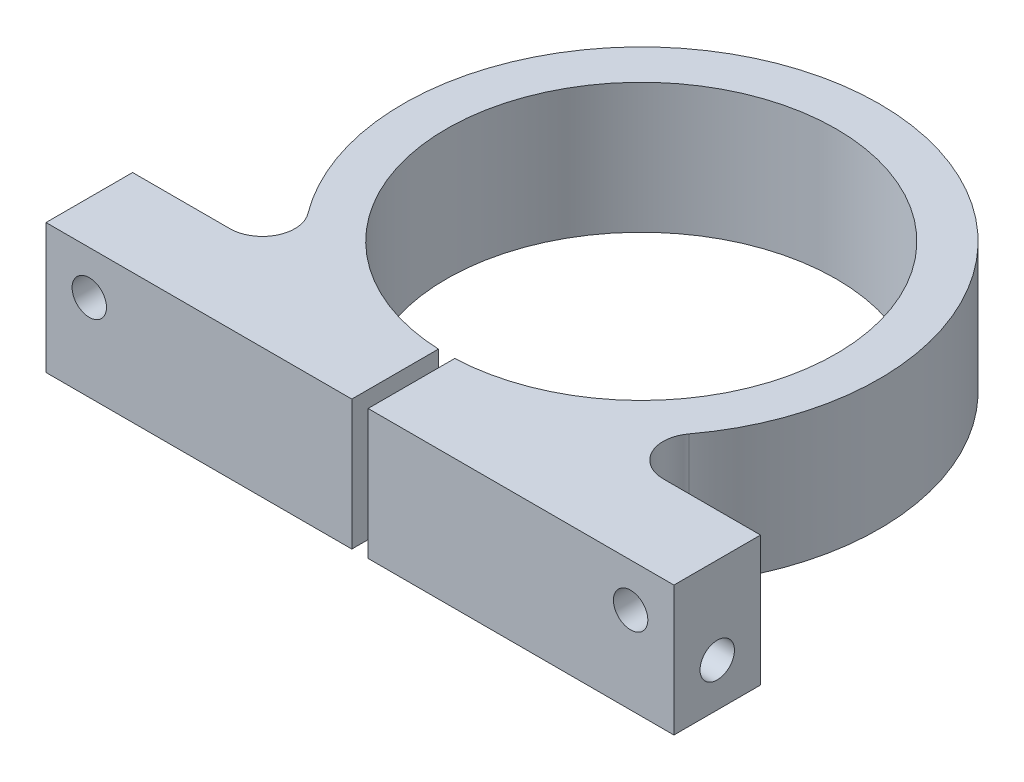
ISO-10303-21;
HEADER;
FILE_DESCRIPTION(('STEP AP214'),'2;1');
FILE_NAME('part.step','',(''),(''),'','','');
FILE_SCHEMA(('AUTOMOTIVE_DESIGN { 1 0 10303 214 1 1 1 1 }'));
ENDSEC;
DATA;
#1=APPLICATION_CONTEXT('core data for automotive mechanical design processes');
#2=APPLICATION_PROTOCOL_DEFINITION('international standard','automotive_design',2000,#1);
#3=PRODUCT_CONTEXT('',#1,'mechanical');
#4=PRODUCT('Part','Part','',(#3));
#5=PRODUCT_RELATED_PRODUCT_CATEGORY('part','',(#4));
#6=PRODUCT_DEFINITION_FORMATION('','',#4);
#7=PRODUCT_DEFINITION_CONTEXT('part definition',#1,'design');
#8=PRODUCT_DEFINITION('design','',#6,#7);
#9=PRODUCT_DEFINITION_SHAPE('','',#8);
#10=(LENGTH_UNIT() NAMED_UNIT(*) SI_UNIT(.MILLI.,.METRE.));
#11=(NAMED_UNIT(*) PLANE_ANGLE_UNIT() SI_UNIT($,.RADIAN.));
#12=(NAMED_UNIT(*) SI_UNIT($,.STERADIAN.) SOLID_ANGLE_UNIT());
#13=UNCERTAINTY_MEASURE_WITH_UNIT(LENGTH_MEASURE(1.E-05),#10,'distance_accuracy_value','');
#14=(GEOMETRIC_REPRESENTATION_CONTEXT(3) GLOBAL_UNCERTAINTY_ASSIGNED_CONTEXT((#13)) GLOBAL_UNIT_ASSIGNED_CONTEXT((#10,
#11,#12)) REPRESENTATION_CONTEXT('',''));
#15=CARTESIAN_POINT('',(0.,0.,0.));
#16=DIRECTION('',(0.,0.,1.));
#17=DIRECTION('',(1.,0.,0.));
#18=AXIS2_PLACEMENT_3D('',#15,#16,#17);
#19=CARTESIAN_POINT('',(-92.075,38.1,57.1001039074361));
#20=DIRECTION('',(1.,0.,0.));
#21=DIRECTION('',(0.,0.,-1.));
#22=AXIS2_PLACEMENT_3D('',#19,#20,#21);
#23=PLANE('',#22);
#24=CARTESIAN_POINT('',(-92.075,12.7,69.8001039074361));
#25=DIRECTION('',(-1.,0.,0.));
#26=DIRECTION('',(0.,0.,1.));
#27=AXIS2_PLACEMENT_3D('',#24,#25,#26);
#28=CIRCLE('',#27,5.04189999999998);
#29=CARTESIAN_POINT('',(-92.075,12.7,74.8420039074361));
#30=VERTEX_POINT('',#29);
#31=EDGE_CURVE('E275',#30,#30,#28,.T.);
#32=ORIENTED_EDGE('',*,*,#31,.F.);
#33=EDGE_LOOP('',(#32));
#34=FACE_BOUND('',#33,.T.);
#35=DIRECTION('',(0.,0.,1.));
#36=VECTOR('',#35,1.);
#37=CARTESIAN_POINT('',(-92.075,0.,57.1001039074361));
#38=LINE('',#37,#36);
#39=CARTESIAN_POINT('',(-92.075,0.,57.1001039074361));
#40=VERTEX_POINT('',#39);
#41=CARTESIAN_POINT('',(-92.075,0.,82.5001039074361));
#42=VERTEX_POINT('',#41);
#43=EDGE_CURVE('E125',#40,#42,#38,.T.);
#44=ORIENTED_EDGE('',*,*,#43,.T.);
#45=DIRECTION('',(0.,-1.,0.));
#46=VECTOR('',#45,1.);
#47=CARTESIAN_POINT('',(-92.075,38.1,82.5001039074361));
#48=LINE('',#47,#46);
#49=CARTESIAN_POINT('',(-92.075,38.1,82.5001039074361));
#50=VERTEX_POINT('',#49);
#51=EDGE_CURVE('E11',#50,#42,#48,.T.);
#52=ORIENTED_EDGE('',*,*,#51,.F.);
#53=DIRECTION('',(0.,0.,1.));
#54=VECTOR('',#53,1.);
#55=CARTESIAN_POINT('',(-92.075,38.1,57.1001039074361));
#56=LINE('',#55,#54);
#57=CARTESIAN_POINT('',(-92.075,38.1,57.1001039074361));
#58=VERTEX_POINT('',#57);
#59=EDGE_CURVE('E165',#58,#50,#56,.T.);
#60=ORIENTED_EDGE('',*,*,#59,.F.);
#61=DIRECTION('',(0.,-1.,0.));
#62=VECTOR('',#61,1.);
#63=CARTESIAN_POINT('',(-92.075,38.1,57.1001039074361));
#64=LINE('',#63,#62);
#65=EDGE_CURVE('E138',#58,#40,#64,.T.);
#66=ORIENTED_EDGE('',*,*,#65,.T.);
#67=EDGE_LOOP('',(#44,#52,#60,#66));
#68=FACE_BOUND('',#67,.T.);
#69=ADVANCED_FACE('F33',(#34,#68),#23,.F.);
#70=CARTESIAN_POINT('',(-92.075,38.1,82.5001039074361));
#71=DIRECTION('',(0.,0.,-1.));
#72=DIRECTION('',(-1.,0.,0.));
#73=AXIS2_PLACEMENT_3D('',#70,#71,#72);
#74=PLANE('',#73);
#75=CARTESIAN_POINT('',(-79.375,25.4,82.5001039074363));
#76=DIRECTION('',(0.,0.,-1.));
#77=DIRECTION('',(-1.,0.,0.));
#78=AXIS2_PLACEMENT_3D('',#75,#76,#77);
#79=CIRCLE('',#78,5.04189999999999);
#80=CARTESIAN_POINT('',(-84.4169,25.4,82.5001039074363));
#81=VERTEX_POINT('',#80);
#82=EDGE_CURVE('E286',#81,#81,#79,.T.);
#83=ORIENTED_EDGE('',*,*,#82,.T.);
#84=EDGE_LOOP('',(#83));
#85=FACE_BOUND('',#84,.T.);
#86=DIRECTION('',(1.,0.,0.));
#87=VECTOR('',#86,1.);
#88=CARTESIAN_POINT('',(-92.075,0.,82.5001039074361));
#89=LINE('',#88,#87);
#90=CARTESIAN_POINT('',(-2.3876,0.,82.5001039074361));
#91=VERTEX_POINT('',#90);
#92=EDGE_CURVE('E121',#42,#91,#89,.T.);
#93=ORIENTED_EDGE('',*,*,#92,.T.);
#94=DIRECTION('',(0.,-1.,0.));
#95=VECTOR('',#94,1.);
#96=CARTESIAN_POINT('',(-2.3876,38.1,82.5001039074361));
#97=LINE('',#96,#95);
#98=CARTESIAN_POINT('',(-2.3876,38.1,82.5001039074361));
#99=VERTEX_POINT('',#98);
#100=EDGE_CURVE('E40',#99,#91,#97,.T.);
#101=ORIENTED_EDGE('',*,*,#100,.F.);
#102=DIRECTION('',(1.,0.,0.));
#103=VECTOR('',#102,1.);
#104=CARTESIAN_POINT('',(-92.075,38.1,82.5001039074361));
#105=LINE('',#104,#103);
#106=EDGE_CURVE('E134',#50,#99,#105,.T.);
#107=ORIENTED_EDGE('',*,*,#106,.F.);
#108=ORIENTED_EDGE('',*,*,#51,.T.);
#109=EDGE_LOOP('',(#93,#101,#107,#108));
#110=FACE_BOUND('',#109,.T.);
#111=ADVANCED_FACE('F133',(#85,#110),#74,.F.);
#112=CARTESIAN_POINT('',(-2.3876,38.1,82.5001039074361));
#113=DIRECTION('',(-1.,0.,0.));
#114=DIRECTION('',(0.,0.,1.));
#115=AXIS2_PLACEMENT_3D('',#112,#113,#114);
#116=PLANE('',#115);
#117=CARTESIAN_POINT('',(-2.3876,12.7,69.8001039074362));
#118=DIRECTION('',(-1.,0.,0.));
#119=DIRECTION('',(0.,0.,1.));
#120=AXIS2_PLACEMENT_3D('',#117,#118,#119);
#121=CIRCLE('',#120,5.04189999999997);
#122=CARTESIAN_POINT('',(-2.3876,12.7,74.8420039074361));
#123=VERTEX_POINT('',#122);
#124=EDGE_CURVE('E139',#123,#123,#121,.T.);
#125=ORIENTED_EDGE('',*,*,#124,.T.);
#126=EDGE_LOOP('',(#125));
#127=FACE_BOUND('',#126,.T.);
#128=DIRECTION('',(0.,0.,-1.));
#129=VECTOR('',#128,1.);
#130=CARTESIAN_POINT('',(-2.3876,0.,82.5001039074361));
#131=LINE('',#130,#129);
#132=CARTESIAN_POINT('',(-2.38760000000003,0.,57.1001039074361));
#133=VERTEX_POINT('',#132);
#134=EDGE_CURVE('E127',#91,#133,#131,.T.);
#135=ORIENTED_EDGE('',*,*,#134,.T.);
#136=DIRECTION('',(0.,-1.,0.));
#137=VECTOR('',#136,1.);
#138=CARTESIAN_POINT('',(-2.38760000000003,38.1,57.1001039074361));
#139=LINE('',#138,#137);
#140=CARTESIAN_POINT('',(-2.38760000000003,38.1,57.1001039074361));
#141=VERTEX_POINT('',#140);
#142=EDGE_CURVE('E211',#141,#133,#139,.T.);
#143=ORIENTED_EDGE('',*,*,#142,.F.);
#144=DIRECTION('',(0.,0.,-1.));
#145=VECTOR('',#144,1.);
#146=CARTESIAN_POINT('',(-2.3876,38.1,82.5001039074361));
#147=LINE('',#146,#145);
#148=EDGE_CURVE('E168',#99,#141,#147,.T.);
#149=ORIENTED_EDGE('',*,*,#148,.F.);
#150=ORIENTED_EDGE('',*,*,#100,.T.);
#151=EDGE_LOOP('',(#135,#143,#149,#150));
#152=FACE_BOUND('',#151,.T.);
#153=ADVANCED_FACE('F215',(#127,#152),#116,.F.);
#154=CARTESIAN_POINT('',(0.,38.1,0.));
#155=DIRECTION('',(0.,-1.,0.));
#156=DIRECTION('',(0.,0.,-1.));
#157=AXIS2_PLACEMENT_3D('',#154,#155,#156);
#158=CYLINDRICAL_SURFACE('',#157,57.15);
#159=CARTESIAN_POINT('',(0.,0.,0.));
#160=DIRECTION('',(0.,-1.,0.));
#161=DIRECTION('',(0.,0.,1.));
#162=AXIS2_PLACEMENT_3D('',#159,#160,#161);
#163=CIRCLE('',#162,57.15);
#164=CARTESIAN_POINT('',(2.3876,0.,57.1001039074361));
#165=VERTEX_POINT('',#164);
#166=EDGE_CURVE('E147',#133,#165,#163,.T.);
#167=ORIENTED_EDGE('',*,*,#166,.T.);
#168=DIRECTION('',(0.,-1.,0.));
#169=VECTOR('',#168,1.);
#170=CARTESIAN_POINT('',(2.3876,38.1,57.1001039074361));
#171=LINE('',#170,#169);
#172=CARTESIAN_POINT('',(2.3876,38.1,57.1001039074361));
#173=VERTEX_POINT('',#172);
#174=EDGE_CURVE('E208',#173,#165,#171,.T.);
#175=ORIENTED_EDGE('',*,*,#174,.F.);
#176=CARTESIAN_POINT('',(0.,38.1,0.));
#177=DIRECTION('',(0.,-1.,0.));
#178=DIRECTION('',(0.,0.,1.));
#179=AXIS2_PLACEMENT_3D('',#176,#177,#178);
#180=CIRCLE('',#179,57.15);
#181=EDGE_CURVE('E170',#141,#173,#180,.T.);
#182=ORIENTED_EDGE('',*,*,#181,.F.);
#183=ORIENTED_EDGE('',*,*,#142,.T.);
#184=EDGE_LOOP('',(#167,#175,#182,#183));
#185=FACE_BOUND('',#184,.T.);
#186=ADVANCED_FACE('F223',(#185),#158,.F.);
#187=CARTESIAN_POINT('',(2.3876,38.1,82.5001039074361));
#188=DIRECTION('',(1.,0.,0.));
#189=DIRECTION('',(0.,0.,-1.));
#190=AXIS2_PLACEMENT_3D('',#187,#188,#189);
#191=PLANE('',#190);
#192=CARTESIAN_POINT('',(2.3876,12.7,69.8001039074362));
#193=DIRECTION('',(1.,0.,0.));
#194=DIRECTION('',(0.,0.,-1.));
#195=AXIS2_PLACEMENT_3D('',#192,#193,#194);
#196=CIRCLE('',#195,5.04189999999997);
#197=CARTESIAN_POINT('',(2.3876,12.7,64.7582039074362));
#198=VERTEX_POINT('',#197);
#199=EDGE_CURVE('E142',#198,#198,#196,.T.);
#200=ORIENTED_EDGE('',*,*,#199,.T.);
#201=EDGE_LOOP('',(#200));
#202=FACE_BOUND('',#201,.T.);
#203=DIRECTION('',(0.,0.,1.));
#204=VECTOR('',#203,1.);
#205=CARTESIAN_POINT('',(2.3876,0.,82.5001039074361));
#206=LINE('',#205,#204);
#207=CARTESIAN_POINT('',(2.3876,0.,82.5001039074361));
#208=VERTEX_POINT('',#207);
#209=EDGE_CURVE('E149',#165,#208,#206,.T.);
#210=ORIENTED_EDGE('',*,*,#209,.T.);
#211=DIRECTION('',(0.,-1.,0.));
#212=VECTOR('',#211,1.);
#213=CARTESIAN_POINT('',(2.3876,38.1,82.5001039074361));
#214=LINE('',#213,#212);
#215=CARTESIAN_POINT('',(2.3876,38.1,82.5001039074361));
#216=VERTEX_POINT('',#215);
#217=EDGE_CURVE('E205',#216,#208,#214,.T.);
#218=ORIENTED_EDGE('',*,*,#217,.F.);
#219=DIRECTION('',(0.,0.,1.));
#220=VECTOR('',#219,1.);
#221=CARTESIAN_POINT('',(2.3876,38.1,82.5001039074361));
#222=LINE('',#221,#220);
#223=EDGE_CURVE('E172',#173,#216,#222,.T.);
#224=ORIENTED_EDGE('',*,*,#223,.F.);
#225=ORIENTED_EDGE('',*,*,#174,.T.);
#226=EDGE_LOOP('',(#210,#218,#224,#225));
#227=FACE_BOUND('',#226,.T.);
#228=ADVANCED_FACE('F226',(#202,#227),#191,.F.);
#229=CARTESIAN_POINT('',(2.3876,38.1,82.5001039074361));
#230=DIRECTION('',(0.,0.,-1.));
#231=DIRECTION('',(-1.,0.,0.));
#232=AXIS2_PLACEMENT_3D('',#229,#230,#231);
#233=PLANE('',#232);
#234=CARTESIAN_POINT('',(79.375,25.4,82.5001039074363));
#235=DIRECTION('',(0.,0.,-1.));
#236=DIRECTION('',(-1.,0.,0.));
#237=AXIS2_PLACEMENT_3D('',#234,#235,#236);
#238=CIRCLE('',#237,5.04189999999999);
#239=CARTESIAN_POINT('',(74.3331,25.4,82.5001039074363));
#240=VERTEX_POINT('',#239);
#241=EDGE_CURVE('E292',#240,#240,#238,.T.);
#242=ORIENTED_EDGE('',*,*,#241,.T.);
#243=EDGE_LOOP('',(#242));
#244=FACE_BOUND('',#243,.T.);
#245=DIRECTION('',(1.,0.,0.));
#246=VECTOR('',#245,1.);
#247=CARTESIAN_POINT('',(2.3876,0.,82.5001039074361));
#248=LINE('',#247,#246);
#249=CARTESIAN_POINT('',(92.075,0.,82.5001039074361));
#250=VERTEX_POINT('',#249);
#251=EDGE_CURVE('E151',#208,#250,#248,.T.);
#252=ORIENTED_EDGE('',*,*,#251,.T.);
#253=DIRECTION('',(0.,-1.,0.));
#254=VECTOR('',#253,1.);
#255=CARTESIAN_POINT('',(92.075,38.1,82.5001039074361));
#256=LINE('',#255,#254);
#257=CARTESIAN_POINT('',(92.075,38.1,82.5001039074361));
#258=VERTEX_POINT('',#257);
#259=EDGE_CURVE('E202',#258,#250,#256,.T.);
#260=ORIENTED_EDGE('',*,*,#259,.F.);
#261=DIRECTION('',(1.,0.,0.));
#262=VECTOR('',#261,1.);
#263=CARTESIAN_POINT('',(2.3876,38.1,82.5001039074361));
#264=LINE('',#263,#262);
#265=EDGE_CURVE('E174',#216,#258,#264,.T.);
#266=ORIENTED_EDGE('',*,*,#265,.F.);
#267=ORIENTED_EDGE('',*,*,#217,.T.);
#268=EDGE_LOOP('',(#252,#260,#266,#267));
#269=FACE_BOUND('',#268,.T.);
#270=ADVANCED_FACE('F231',(#244,#269),#233,.F.);
#271=CARTESIAN_POINT('',(92.075,38.1,57.1001039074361));
#272=DIRECTION('',(-1.,0.,0.));
#273=DIRECTION('',(0.,0.,1.));
#274=AXIS2_PLACEMENT_3D('',#271,#272,#273);
#275=PLANE('',#274);
#276=CARTESIAN_POINT('',(92.075,12.7,69.8001039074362));
#277=DIRECTION('',(-1.,0.,0.));
#278=DIRECTION('',(0.,0.,1.));
#279=AXIS2_PLACEMENT_3D('',#276,#277,#278);
#280=CIRCLE('',#279,5.04189999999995);
#281=CARTESIAN_POINT('',(92.075,12.7,74.8420039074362));
#282=VERTEX_POINT('',#281);
#283=EDGE_CURVE('E277',#282,#282,#280,.T.);
#284=ORIENTED_EDGE('',*,*,#283,.T.);
#285=EDGE_LOOP('',(#284));
#286=FACE_BOUND('',#285,.T.);
#287=DIRECTION('',(0.,0.,-1.));
#288=VECTOR('',#287,1.);
#289=CARTESIAN_POINT('',(92.075,0.,57.1001039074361));
#290=LINE('',#289,#288);
#291=CARTESIAN_POINT('',(92.075,0.,57.1001039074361));
#292=VERTEX_POINT('',#291);
#293=EDGE_CURVE('E153',#250,#292,#290,.T.);
#294=ORIENTED_EDGE('',*,*,#293,.T.);
#295=DIRECTION('',(0.,-1.,0.));
#296=VECTOR('',#295,1.);
#297=CARTESIAN_POINT('',(92.075,38.1,57.1001039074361));
#298=LINE('',#297,#296);
#299=CARTESIAN_POINT('',(92.075,38.1,57.1001039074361));
#300=VERTEX_POINT('',#299);
#301=EDGE_CURVE('E199',#300,#292,#298,.T.);
#302=ORIENTED_EDGE('',*,*,#301,.F.);
#303=DIRECTION('',(0.,0.,-1.));
#304=VECTOR('',#303,1.);
#305=CARTESIAN_POINT('',(92.075,38.1,57.1001039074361));
#306=LINE('',#305,#304);
#307=EDGE_CURVE('E176',#258,#300,#306,.T.);
#308=ORIENTED_EDGE('',*,*,#307,.F.);
#309=ORIENTED_EDGE('',*,*,#259,.T.);
#310=EDGE_LOOP('',(#294,#302,#308,#309));
#311=FACE_BOUND('',#310,.T.);
#312=ADVANCED_FACE('F237',(#286,#311),#275,.F.);
#313=CARTESIAN_POINT('',(63.537391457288,38.1,57.1001039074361));
#314=DIRECTION('',(0.,0.,1.));
#315=DIRECTION('',(1.,0.,0.));
#316=AXIS2_PLACEMENT_3D('',#313,#314,#315);
#317=PLANE('',#316);
#318=CARTESIAN_POINT('',(79.375,25.4,57.1001039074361));
#319=DIRECTION('',(0.,0.,-1.));
#320=DIRECTION('',(-1.,0.,0.));
#321=AXIS2_PLACEMENT_3D('',#318,#319,#320);
#322=CIRCLE('',#321,5.0419);
#323=CARTESIAN_POINT('',(74.3331,25.4,57.1001039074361));
#324=VERTEX_POINT('',#323);
#325=EDGE_CURVE('E289',#324,#324,#322,.T.);
#326=ORIENTED_EDGE('',*,*,#325,.F.);
#327=EDGE_LOOP('',(#326));
#328=FACE_BOUND('',#327,.T.);
#329=DIRECTION('',(-1.,0.,0.));
#330=VECTOR('',#329,1.);
#331=CARTESIAN_POINT('',(63.537391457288,0.,57.1001039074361));
#332=LINE('',#331,#330);
#333=CARTESIAN_POINT('',(63.537391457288,0.,57.1001039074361));
#334=VERTEX_POINT('',#333);
#335=EDGE_CURVE('E155',#292,#334,#332,.T.);
#336=ORIENTED_EDGE('',*,*,#335,.T.);
#337=DIRECTION('',(0.,-1.,0.));
#338=VECTOR('',#337,1.);
#339=CARTESIAN_POINT('',(63.537391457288,38.1,57.1001039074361));
#340=LINE('',#339,#338);
#341=CARTESIAN_POINT('',(63.537391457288,38.1,57.1001039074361));
#342=VERTEX_POINT('',#341);
#343=EDGE_CURVE('E196',#342,#334,#340,.T.);
#344=ORIENTED_EDGE('',*,*,#343,.F.);
#345=DIRECTION('',(-1.,0.,0.));
#346=VECTOR('',#345,1.);
#347=CARTESIAN_POINT('',(63.537391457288,38.1,57.1001039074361));
#348=LINE('',#347,#346);
#349=EDGE_CURVE('E178',#300,#342,#348,.T.);
#350=ORIENTED_EDGE('',*,*,#349,.F.);
#351=ORIENTED_EDGE('',*,*,#301,.T.);
#352=EDGE_LOOP('',(#336,#344,#350,#351));
#353=FACE_BOUND('',#352,.T.);
#354=ADVANCED_FACE('F241',(#328,#353),#317,.F.);
#355=CARTESIAN_POINT('',(63.537391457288,38.1,47.5751039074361));
#356=DIRECTION('',(0.,-1.,0.));
#357=DIRECTION('',(0.,0.,-1.));
#358=AXIS2_PLACEMENT_3D('',#355,#356,#357);
#359=CYLINDRICAL_SURFACE('',#358,9.525);
#360=CARTESIAN_POINT('',(63.537391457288,0.,47.5751039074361));
#361=DIRECTION('',(0.,-1.,0.));
#362=DIRECTION('',(0.,0.,-1.));
#363=AXIS2_PLACEMENT_3D('',#360,#361,#362);
#364=CIRCLE('',#363,9.525);
#365=CARTESIAN_POINT('',(55.9129044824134,0.,41.8660914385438));
#366=VERTEX_POINT('',#365);
#367=EDGE_CURVE('E157',#334,#366,#364,.T.);
#368=ORIENTED_EDGE('',*,*,#367,.T.);
#369=DIRECTION('',(0.,-1.,0.));
#370=VECTOR('',#369,1.);
#371=CARTESIAN_POINT('',(55.9129044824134,38.1,41.8660914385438));
#372=LINE('',#371,#370);
#373=CARTESIAN_POINT('',(55.9129044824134,38.1,41.8660914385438));
#374=VERTEX_POINT('',#373);
#375=EDGE_CURVE('E193',#374,#366,#372,.T.);
#376=ORIENTED_EDGE('',*,*,#375,.F.);
#377=CARTESIAN_POINT('',(63.537391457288,38.1,47.5751039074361));
#378=DIRECTION('',(0.,-1.,0.));
#379=DIRECTION('',(0.,0.,-1.));
#380=AXIS2_PLACEMENT_3D('',#377,#378,#379);
#381=CIRCLE('',#380,9.525);
#382=EDGE_CURVE('E180',#342,#374,#381,.T.);
#383=ORIENTED_EDGE('',*,*,#382,.F.);
#384=ORIENTED_EDGE('',*,*,#343,.T.);
#385=EDGE_LOOP('',(#368,#376,#383,#384));
#386=FACE_BOUND('',#385,.T.);
#387=ADVANCED_FACE('F246',(#386),#359,.F.);
#388=CARTESIAN_POINT('',(0.,38.1,0.));
#389=DIRECTION('',(0.,-1.,0.));
#390=DIRECTION('',(0.,0.,-1.));
#391=AXIS2_PLACEMENT_3D('',#388,#389,#390);
#392=CYLINDRICAL_SURFACE('',#391,69.85);
#393=CARTESIAN_POINT('',(0.,0.,0.));
#394=DIRECTION('',(0.,1.,0.));
#395=DIRECTION('',(0.,0.,1.));
#396=AXIS2_PLACEMENT_3D('',#393,#394,#395);
#397=CIRCLE('',#396,69.85);
#398=CARTESIAN_POINT('',(-55.9129044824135,0.,41.8660914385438));
#399=VERTEX_POINT('',#398);
#400=EDGE_CURVE('E159',#366,#399,#397,.T.);
#401=ORIENTED_EDGE('',*,*,#400,.T.);
#402=DIRECTION('',(0.,-1.,0.));
#403=VECTOR('',#402,1.);
#404=CARTESIAN_POINT('',(-55.9129044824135,38.1,41.8660914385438));
#405=LINE('',#404,#403);
#406=CARTESIAN_POINT('',(-55.9129044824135,38.1,41.8660914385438));
#407=VERTEX_POINT('',#406);
#408=EDGE_CURVE('E190',#407,#399,#405,.T.);
#409=ORIENTED_EDGE('',*,*,#408,.F.);
#410=CARTESIAN_POINT('',(0.,38.1,0.));
#411=DIRECTION('',(0.,1.,0.));
#412=DIRECTION('',(0.,0.,1.));
#413=AXIS2_PLACEMENT_3D('',#410,#411,#412);
#414=CIRCLE('',#413,69.85);
#415=EDGE_CURVE('E182',#374,#407,#414,.T.);
#416=ORIENTED_EDGE('',*,*,#415,.F.);
#417=ORIENTED_EDGE('',*,*,#375,.T.);
#418=EDGE_LOOP('',(#401,#409,#416,#417));
#419=FACE_BOUND('',#418,.T.);
#420=ADVANCED_FACE('F250',(#419),#392,.T.);
#421=CARTESIAN_POINT('',(-63.537391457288,38.1,47.5751039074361));
#422=DIRECTION('',(0.,-1.,0.));
#423=DIRECTION('',(0.,0.,-1.));
#424=AXIS2_PLACEMENT_3D('',#421,#422,#423);
#425=CYLINDRICAL_SURFACE('',#424,9.525);
#426=CARTESIAN_POINT('',(-63.537391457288,0.,47.5751039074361));
#427=DIRECTION('',(0.,-1.,0.));
#428=DIRECTION('',(0.,0.,1.));
#429=AXIS2_PLACEMENT_3D('',#426,#427,#428);
#430=CIRCLE('',#429,9.525);
#431=CARTESIAN_POINT('',(-63.537391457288,0.,57.1001039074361));
#432=VERTEX_POINT('',#431);
#433=EDGE_CURVE('E161',#399,#432,#430,.T.);
#434=ORIENTED_EDGE('',*,*,#433,.T.);
#435=DIRECTION('',(0.,-1.,0.));
#436=VECTOR('',#435,1.);
#437=CARTESIAN_POINT('',(-63.537391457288,38.1,57.1001039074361));
#438=LINE('',#437,#436);
#439=CARTESIAN_POINT('',(-63.537391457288,38.1,57.1001039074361));
#440=VERTEX_POINT('',#439);
#441=EDGE_CURVE('E187',#440,#432,#438,.T.);
#442=ORIENTED_EDGE('',*,*,#441,.F.);
#443=CARTESIAN_POINT('',(-63.537391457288,38.1,47.5751039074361));
#444=DIRECTION('',(0.,-1.,0.));
#445=DIRECTION('',(0.,0.,1.));
#446=AXIS2_PLACEMENT_3D('',#443,#444,#445);
#447=CIRCLE('',#446,9.525);
#448=EDGE_CURVE('E52',#407,#440,#447,.T.);
#449=ORIENTED_EDGE('',*,*,#448,.F.);
#450=ORIENTED_EDGE('',*,*,#408,.T.);
#451=EDGE_LOOP('',(#434,#442,#449,#450));
#452=FACE_BOUND('',#451,.T.);
#453=ADVANCED_FACE('F254',(#452),#425,.F.);
#454=CARTESIAN_POINT('',(-92.075,38.1,57.1001039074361));
#455=DIRECTION('',(0.,0.,1.));
#456=DIRECTION('',(1.,0.,0.));
#457=AXIS2_PLACEMENT_3D('',#454,#455,#456);
#458=PLANE('',#457);
#459=CARTESIAN_POINT('',(-79.375,25.4,57.1001039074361));
#460=DIRECTION('',(0.,0.,-1.));
#461=DIRECTION('',(-1.,0.,0.));
#462=AXIS2_PLACEMENT_3D('',#459,#460,#461);
#463=CIRCLE('',#462,5.0419);
#464=CARTESIAN_POINT('',(-84.4169,25.4,57.1001039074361));
#465=VERTEX_POINT('',#464);
#466=EDGE_CURVE('E281',#465,#465,#463,.T.);
#467=ORIENTED_EDGE('',*,*,#466,.F.);
#468=EDGE_LOOP('',(#467));
#469=FACE_BOUND('',#468,.T.);
#470=DIRECTION('',(-1.,0.,0.));
#471=VECTOR('',#470,1.);
#472=CARTESIAN_POINT('',(-92.075,0.,57.1001039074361));
#473=LINE('',#472,#471);
#474=EDGE_CURVE('E163',#432,#40,#473,.T.);
#475=ORIENTED_EDGE('',*,*,#474,.T.);
#476=ORIENTED_EDGE('',*,*,#65,.F.);
#477=DIRECTION('',(-1.,0.,0.));
#478=VECTOR('',#477,1.);
#479=CARTESIAN_POINT('',(-92.075,38.1,57.1001039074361));
#480=LINE('',#479,#478);
#481=EDGE_CURVE('E47',#440,#58,#480,.T.);
#482=ORIENTED_EDGE('',*,*,#481,.F.);
#483=ORIENTED_EDGE('',*,*,#441,.T.);
#484=EDGE_LOOP('',(#475,#476,#482,#483));
#485=FACE_BOUND('',#484,.T.);
#486=ADVANCED_FACE('F256',(#469,#485),#458,.F.);
#487=CARTESIAN_POINT('',(0.,38.1,0.));
#488=DIRECTION('',(0.,1.,0.));
#489=DIRECTION('',(0.,0.,1.));
#490=AXIS2_PLACEMENT_3D('',#487,#488,#489);
#491=PLANE('',#490);
#492=ORIENTED_EDGE('',*,*,#59,.T.);
#493=ORIENTED_EDGE('',*,*,#106,.T.);
#494=ORIENTED_EDGE('',*,*,#148,.T.);
#495=ORIENTED_EDGE('',*,*,#181,.T.);
#496=ORIENTED_EDGE('',*,*,#223,.T.);
#497=ORIENTED_EDGE('',*,*,#265,.T.);
#498=ORIENTED_EDGE('',*,*,#307,.T.);
#499=ORIENTED_EDGE('',*,*,#349,.T.);
#500=ORIENTED_EDGE('',*,*,#382,.T.);
#501=ORIENTED_EDGE('',*,*,#415,.T.);
#502=ORIENTED_EDGE('',*,*,#448,.T.);
#503=ORIENTED_EDGE('',*,*,#481,.T.);
#504=EDGE_LOOP('',(#492,#493,#494,#495,#496,#497,#498,#499,#500,#501,#502,#503));
#505=FACE_BOUND('',#504,.T.);
#506=ADVANCED_FACE('F218',(#505),#491,.T.);
#507=CARTESIAN_POINT('',(0.,0.,0.));
#508=DIRECTION('',(0.,1.,0.));
#509=DIRECTION('',(0.,0.,1.));
#510=AXIS2_PLACEMENT_3D('',#507,#508,#509);
#511=PLANE('',#510);
#512=ORIENTED_EDGE('',*,*,#43,.F.);
#513=ORIENTED_EDGE('',*,*,#474,.F.);
#514=ORIENTED_EDGE('',*,*,#433,.F.);
#515=ORIENTED_EDGE('',*,*,#400,.F.);
#516=ORIENTED_EDGE('',*,*,#367,.F.);
#517=ORIENTED_EDGE('',*,*,#335,.F.);
#518=ORIENTED_EDGE('',*,*,#293,.F.);
#519=ORIENTED_EDGE('',*,*,#251,.F.);
#520=ORIENTED_EDGE('',*,*,#209,.F.);
#521=ORIENTED_EDGE('',*,*,#166,.F.);
#522=ORIENTED_EDGE('',*,*,#134,.F.);
#523=ORIENTED_EDGE('',*,*,#92,.F.);
#524=EDGE_LOOP('',(#512,#513,#514,#515,#516,#517,#518,#519,#520,#521,#522,#523));
#525=FACE_BOUND('',#524,.T.);
#526=ADVANCED_FACE('F122',(#525),#511,.F.);
#527=CARTESIAN_POINT('',(-92.075,12.7,69.8001039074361));
#528=DIRECTION('',(-1.,0.,0.));
#529=DIRECTION('',(0.,0.,1.));
#530=AXIS2_PLACEMENT_3D('',#527,#528,#529);
#531=CYLINDRICAL_SURFACE('',#530,5.04189999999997);
#532=ORIENTED_EDGE('',*,*,#283,.F.);
#533=EDGE_LOOP('',(#532));
#534=FACE_BOUND('',#533,.T.);
#535=ORIENTED_EDGE('',*,*,#199,.F.);
#536=EDGE_LOOP('',(#535));
#537=FACE_BOUND('',#536,.T.);
#538=ADVANCED_FACE('F330',(#534,#537),#531,.F.);
#539=ORIENTED_EDGE('',*,*,#31,.T.);
#540=EDGE_LOOP('',(#539));
#541=FACE_BOUND('',#540,.T.);
#542=ORIENTED_EDGE('',*,*,#124,.F.);
#543=EDGE_LOOP('',(#542));
#544=FACE_BOUND('',#543,.T.);
#545=ADVANCED_FACE('F328',(#541,#544),#531,.F.);
#546=CARTESIAN_POINT('',(-79.375,25.4,57.1001039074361));
#547=DIRECTION('',(0.,0.,-1.));
#548=DIRECTION('',(-1.,0.,0.));
#549=AXIS2_PLACEMENT_3D('',#546,#547,#548);
#550=CYLINDRICAL_SURFACE('',#549,5.04189999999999);
#551=ORIENTED_EDGE('',*,*,#82,.F.);
#552=EDGE_LOOP('',(#551));
#553=FACE_BOUND('',#552,.T.);
#554=ORIENTED_EDGE('',*,*,#466,.T.);
#555=EDGE_LOOP('',(#554));
#556=FACE_BOUND('',#555,.T.);
#557=ADVANCED_FACE('F300',(#553,#556),#550,.F.);
#558=CARTESIAN_POINT('',(79.375,25.4,57.1001039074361));
#559=DIRECTION('',(0.,0.,-1.));
#560=DIRECTION('',(-1.,0.,0.));
#561=AXIS2_PLACEMENT_3D('',#558,#559,#560);
#562=CYLINDRICAL_SURFACE('',#561,5.04189999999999);
#563=ORIENTED_EDGE('',*,*,#241,.F.);
#564=EDGE_LOOP('',(#563));
#565=FACE_BOUND('',#564,.T.);
#566=ORIENTED_EDGE('',*,*,#325,.T.);
#567=EDGE_LOOP('',(#566));
#568=FACE_BOUND('',#567,.T.);
#569=ADVANCED_FACE('F297',(#565,#568),#562,.F.);
#570=CLOSED_SHELL('',(#69,#111,#153,#186,#228,#270,#312,#354,#387,#420,#453,#486,#506,#526,#538,
#545,#557,#569));
#571=MANIFOLD_SOLID_BREP('B2',#570);
#572=ADVANCED_BREP_SHAPE_REPRESENTATION('',(#18,#571),#14);
#573=SHAPE_DEFINITION_REPRESENTATION(#9,#572);
ENDSEC;
END-ISO-10303-21;
